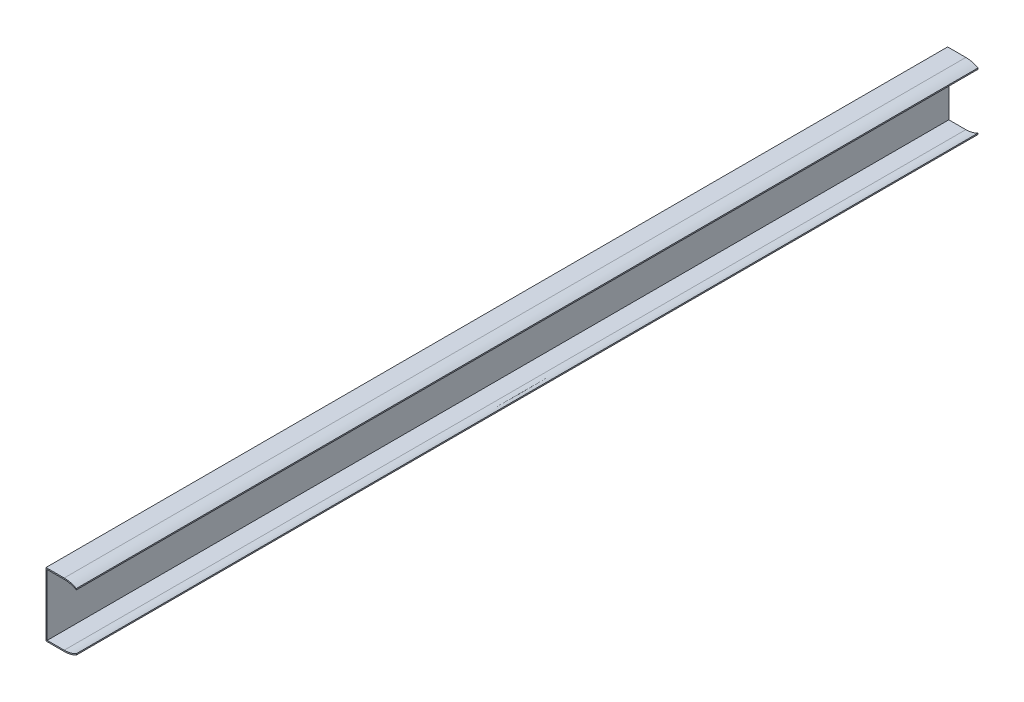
from build123d import *

# Parameters (mm, degrees)
EXTRUSION1_DEPTH = 1485


with BuildPart() as part:
    # Esquisse1 → Extrusion1 (new body)
    with BuildSketch(Plane.XY):
        with BuildLine():
            Line((0, 0), (0, 105))
            Line((0, 105), (30, 105))
            add(Edge.make_bspline(
                [(30, 105), (40.603281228, 104.951543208), (50, 100)],
                knots=[0, 0, 0, 1, 1, 1], degree=2))
            Line((50, 100), (50, 98))
            add(Edge.make_bspline(
                [(30, 103), (40.603281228, 102.951543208), (50, 98)],
                knots=[0, 0, 0, 1, 1, 1], degree=2))
            Line((30, 103), (2, 103))
            Line((2, 103), (2, 2))
            Line((2, 2), (30, 2))
            add(Edge.make_bspline(
                [(30, 2), (40.603281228, 2.048456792), (50, 7)],
                knots=[0, 0, 0, 1, 1, 1], degree=2))
            Line((50, 7), (50, 5))
            add(Edge.make_bspline(
                [(30, 0), (40.603281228, 0.048456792), (50, 5)],
                knots=[0, 0, 0, 1, 1, 1], degree=2))
            Line((30, 0), (0, 0))
        make_face()
    extrude(amount=EXTRUSION1_DEPTH)


solid = part.part
